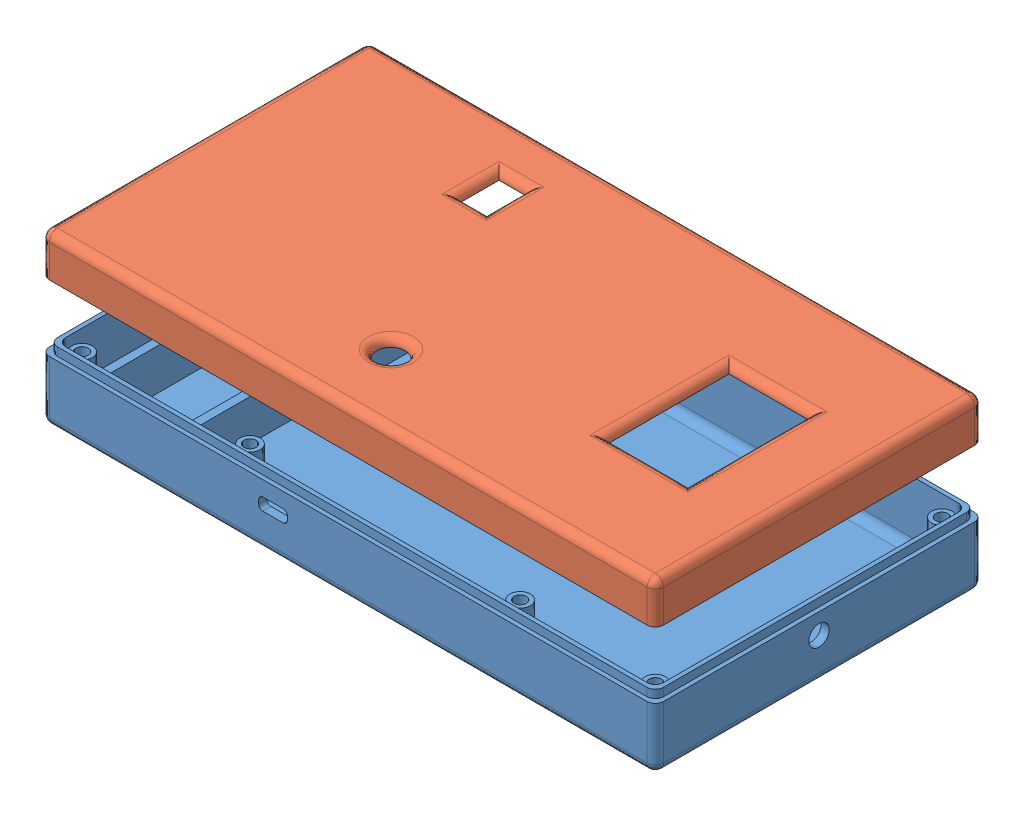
SolidWorks assembly Assem1.sldasm, configuration Default (file format 13000). Lengths in mm.
Overall size (150 41.17 80).
2 component instances, 2 part files, 2 mates.
Components (placement in the parent):
- Part9-1: Part9.SLDPRT [Default] at (51.6405 63.2582 121.8631) size (150 17 80)
- Part10-1: Part10.SLDPRT [Default] at (51.6405 104.4256 121.8631) x (1 0 0) z (0 0 -1) size (150 10 80)
Mates (geometry in assembly coordinates):
- Coincident3: coincident: plane of Part9-1 through (-23.3595 78.2582 161.8631) normal (0 0 1); plane of Part10-1 through (-23.3595 94.4256 161.8631) normal (0 0 1)
- Coincident4: coincident aligned: plane of Part9-1 through (-23.3595 78.2582 81.8631) normal (-1 0 0); plane of Part10-1 through (-23.3595 94.4256 161.8631) normal (-1 0 0)
